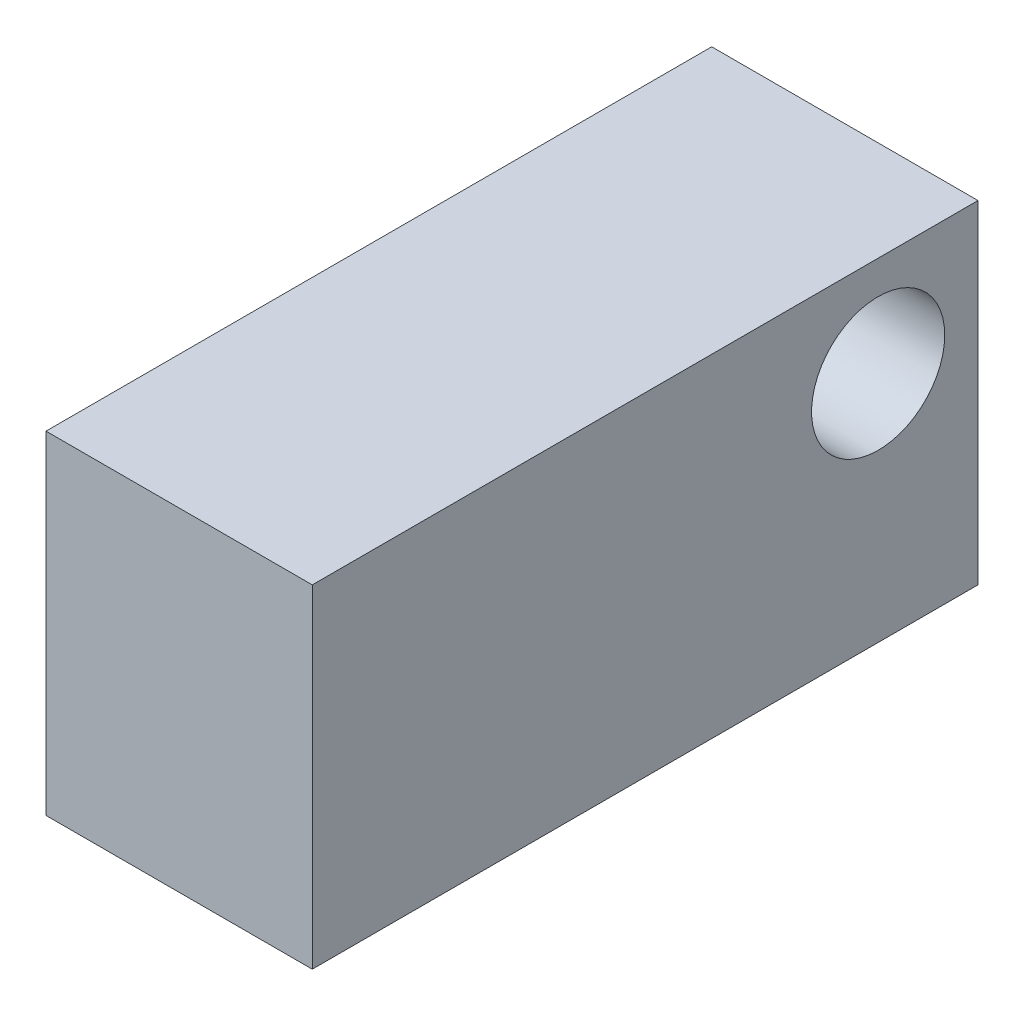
ISO-10303-21;
HEADER;
FILE_DESCRIPTION(('STEP AP214'),'2;1');
FILE_NAME('part.step','',(''),(''),'','','');
FILE_SCHEMA(('AUTOMOTIVE_DESIGN { 1 0 10303 214 1 1 1 1 }'));
ENDSEC;
DATA;
#1=APPLICATION_CONTEXT('core data for automotive mechanical design processes');
#2=APPLICATION_PROTOCOL_DEFINITION('international standard','automotive_design',2000,#1);
#3=PRODUCT_CONTEXT('',#1,'mechanical');
#4=PRODUCT('Part','Part','',(#3));
#5=PRODUCT_RELATED_PRODUCT_CATEGORY('part','',(#4));
#6=PRODUCT_DEFINITION_FORMATION('','',#4);
#7=PRODUCT_DEFINITION_CONTEXT('part definition',#1,'design');
#8=PRODUCT_DEFINITION('design','',#6,#7);
#9=PRODUCT_DEFINITION_SHAPE('','',#8);
#10=(LENGTH_UNIT() NAMED_UNIT(*) SI_UNIT(.MILLI.,.METRE.));
#11=(NAMED_UNIT(*) PLANE_ANGLE_UNIT() SI_UNIT($,.RADIAN.));
#12=(NAMED_UNIT(*) SI_UNIT($,.STERADIAN.) SOLID_ANGLE_UNIT());
#13=UNCERTAINTY_MEASURE_WITH_UNIT(LENGTH_MEASURE(1.E-05),#10,'distance_accuracy_value','');
#14=(GEOMETRIC_REPRESENTATION_CONTEXT(3) GLOBAL_UNCERTAINTY_ASSIGNED_CONTEXT((#13)) GLOBAL_UNIT_ASSIGNED_CONTEXT((#10,
#11,#12)) REPRESENTATION_CONTEXT('',''));
#15=CARTESIAN_POINT('',(0.,0.,0.));
#16=DIRECTION('',(0.,0.,1.));
#17=DIRECTION('',(1.,0.,0.));
#18=AXIS2_PLACEMENT_3D('',#15,#16,#17);
#19=CARTESIAN_POINT('',(-40.,-150.,120.));
#20=DIRECTION('',(0.,0.,1.));
#21=DIRECTION('',(0.,-1.,0.));
#22=AXIS2_PLACEMENT_3D('',#19,#20,#21);
#23=PLANE('',#22);
#24=DIRECTION('',(0.,-1.,0.));
#25=VECTOR('',#24,1.);
#26=CARTESIAN_POINT('',(0.,-150.,120.));
#27=LINE('',#26,#25);
#28=CARTESIAN_POINT('',(0.,-100.,120.));
#29=VERTEX_POINT('',#28);
#30=CARTESIAN_POINT('',(0.,-150.,120.));
#31=VERTEX_POINT('',#30);
#32=EDGE_CURVE('E100',#29,#31,#27,.T.);
#33=ORIENTED_EDGE('',*,*,#32,.F.);
#34=DIRECTION('',(1.,0.,0.));
#35=VECTOR('',#34,1.);
#36=CARTESIAN_POINT('',(-40.,-100.,120.));
#37=LINE('',#36,#35);
#38=CARTESIAN_POINT('',(-40.,-100.,120.));
#39=VERTEX_POINT('',#38);
#40=EDGE_CURVE('E11',#39,#29,#37,.T.);
#41=ORIENTED_EDGE('',*,*,#40,.F.);
#42=DIRECTION('',(0.,-1.,0.));
#43=VECTOR('',#42,1.);
#44=CARTESIAN_POINT('',(-40.,-150.,120.));
#45=LINE('',#44,#43);
#46=CARTESIAN_POINT('',(-40.,-150.,120.));
#47=VERTEX_POINT('',#46);
#48=EDGE_CURVE('E93',#39,#47,#45,.T.);
#49=ORIENTED_EDGE('',*,*,#48,.T.);
#50=DIRECTION('',(1.,0.,0.));
#51=VECTOR('',#50,1.);
#52=CARTESIAN_POINT('',(-40.,-150.,120.));
#53=LINE('',#52,#51);
#54=EDGE_CURVE('E38',#47,#31,#53,.T.);
#55=ORIENTED_EDGE('',*,*,#54,.T.);
#56=EDGE_LOOP('',(#33,#41,#49,#55));
#57=FACE_BOUND('',#56,.T.);
#58=ADVANCED_FACE('F35',(#57),#23,.T.);
#59=CARTESIAN_POINT('',(-40.,-100.,120.));
#60=DIRECTION('',(0.,1.,0.));
#61=DIRECTION('',(0.,0.,1.));
#62=AXIS2_PLACEMENT_3D('',#59,#60,#61);
#63=PLANE('',#62);
#64=DIRECTION('',(0.,0.,1.));
#65=VECTOR('',#64,1.);
#66=CARTESIAN_POINT('',(0.,-100.,120.));
#67=LINE('',#66,#65);
#68=CARTESIAN_POINT('',(0.,-100.,20.));
#69=VERTEX_POINT('',#68);
#70=EDGE_CURVE('E95',#69,#29,#67,.T.);
#71=ORIENTED_EDGE('',*,*,#70,.F.);
#72=DIRECTION('',(1.,0.,0.));
#73=VECTOR('',#72,1.);
#74=CARTESIAN_POINT('',(-40.,-100.,20.));
#75=LINE('',#74,#73);
#76=CARTESIAN_POINT('',(-40.,-100.,20.));
#77=VERTEX_POINT('',#76);
#78=EDGE_CURVE('E44',#77,#69,#75,.T.);
#79=ORIENTED_EDGE('',*,*,#78,.F.);
#80=DIRECTION('',(0.,0.,1.));
#81=VECTOR('',#80,1.);
#82=CARTESIAN_POINT('',(-40.,-100.,120.));
#83=LINE('',#82,#81);
#84=EDGE_CURVE('E90',#77,#39,#83,.T.);
#85=ORIENTED_EDGE('',*,*,#84,.T.);
#86=ORIENTED_EDGE('',*,*,#40,.T.);
#87=EDGE_LOOP('',(#71,#79,#85,#86));
#88=FACE_BOUND('',#87,.T.);
#89=ADVANCED_FACE('F111',(#88),#63,.T.);
#90=CARTESIAN_POINT('',(-40.,-150.,20.));
#91=DIRECTION('',(0.,0.,-1.));
#92=DIRECTION('',(0.,1.,0.));
#93=AXIS2_PLACEMENT_3D('',#90,#91,#92);
#94=PLANE('',#93);
#95=DIRECTION('',(0.,1.,0.));
#96=VECTOR('',#95,1.);
#97=CARTESIAN_POINT('',(0.,-150.,20.));
#98=LINE('',#97,#96);
#99=CARTESIAN_POINT('',(0.,-150.,20.));
#100=VERTEX_POINT('',#99);
#101=EDGE_CURVE('E85',#100,#69,#98,.T.);
#102=ORIENTED_EDGE('',*,*,#101,.F.);
#103=DIRECTION('',(1.,0.,0.));
#104=VECTOR('',#103,1.);
#105=CARTESIAN_POINT('',(-40.,-150.,20.));
#106=LINE('',#105,#104);
#107=CARTESIAN_POINT('',(-40.,-150.,20.));
#108=VERTEX_POINT('',#107);
#109=EDGE_CURVE('E80',#108,#100,#106,.T.);
#110=ORIENTED_EDGE('',*,*,#109,.F.);
#111=DIRECTION('',(0.,1.,0.));
#112=VECTOR('',#111,1.);
#113=CARTESIAN_POINT('',(-40.,-150.,20.));
#114=LINE('',#113,#112);
#115=EDGE_CURVE('E83',#108,#77,#114,.T.);
#116=ORIENTED_EDGE('',*,*,#115,.T.);
#117=ORIENTED_EDGE('',*,*,#78,.T.);
#118=EDGE_LOOP('',(#102,#110,#116,#117));
#119=FACE_BOUND('',#118,.T.);
#120=ADVANCED_FACE('F82',(#119),#94,.T.);
#121=CARTESIAN_POINT('',(-40.,-150.,120.));
#122=DIRECTION('',(0.,-1.,0.));
#123=DIRECTION('',(0.,0.,-1.));
#124=AXIS2_PLACEMENT_3D('',#121,#122,#123);
#125=PLANE('',#124);
#126=DIRECTION('',(0.,0.,-1.));
#127=VECTOR('',#126,1.);
#128=CARTESIAN_POINT('',(0.,-150.,120.));
#129=LINE('',#128,#127);
#130=EDGE_CURVE('E103',#31,#100,#129,.T.);
#131=ORIENTED_EDGE('',*,*,#130,.F.);
#132=ORIENTED_EDGE('',*,*,#54,.F.);
#133=DIRECTION('',(0.,0.,-1.));
#134=VECTOR('',#133,1.);
#135=CARTESIAN_POINT('',(-40.,-150.,120.));
#136=LINE('',#135,#134);
#137=EDGE_CURVE('E89',#47,#108,#136,.T.);
#138=ORIENTED_EDGE('',*,*,#137,.T.);
#139=ORIENTED_EDGE('',*,*,#109,.T.);
#140=EDGE_LOOP('',(#131,#132,#138,#139));
#141=FACE_BOUND('',#140,.T.);
#142=ADVANCED_FACE('F92',(#141),#125,.T.);
#143=CARTESIAN_POINT('',(-40.,-100.,120.));
#144=DIRECTION('',(-1.,0.,0.));
#145=DIRECTION('',(0.,0.,1.));
#146=AXIS2_PLACEMENT_3D('',#143,#144,#145);
#147=PLANE('',#146);
#148=CARTESIAN_POINT('',(-40.,-115.,35.));
#149=DIRECTION('',(1.,0.,0.));
#150=DIRECTION('',(0.,0.,-1.));
#151=AXIS2_PLACEMENT_3D('',#148,#149,#150);
#152=CIRCLE('',#151,10.);
#153=CARTESIAN_POINT('',(-40.,-115.,25.));
#154=VERTEX_POINT('',#153);
#155=EDGE_CURVE('E104',#154,#154,#152,.T.);
#156=ORIENTED_EDGE('',*,*,#155,.T.);
#157=EDGE_LOOP('',(#156));
#158=FACE_BOUND('',#157,.T.);
#159=ORIENTED_EDGE('',*,*,#48,.F.);
#160=ORIENTED_EDGE('',*,*,#84,.F.);
#161=ORIENTED_EDGE('',*,*,#115,.F.);
#162=ORIENTED_EDGE('',*,*,#137,.F.);
#163=EDGE_LOOP('',(#159,#160,#161,#162));
#164=FACE_BOUND('',#163,.T.);
#165=ADVANCED_FACE('F88',(#158,#164),#147,.T.);
#166=CARTESIAN_POINT('',(0.,-100.,120.));
#167=DIRECTION('',(-1.,0.,0.));
#168=DIRECTION('',(0.,0.,1.));
#169=AXIS2_PLACEMENT_3D('',#166,#167,#168);
#170=PLANE('',#169);
#171=CARTESIAN_POINT('',(0.,-115.,35.));
#172=DIRECTION('',(1.,0.,0.));
#173=DIRECTION('',(0.,0.,-1.));
#174=AXIS2_PLACEMENT_3D('',#171,#172,#173);
#175=CIRCLE('',#174,10.);
#176=CARTESIAN_POINT('',(0.,-115.,25.));
#177=VERTEX_POINT('',#176);
#178=EDGE_CURVE('E141',#177,#177,#175,.T.);
#179=ORIENTED_EDGE('',*,*,#178,.F.);
#180=EDGE_LOOP('',(#179));
#181=FACE_BOUND('',#180,.T.);
#182=ORIENTED_EDGE('',*,*,#32,.T.);
#183=ORIENTED_EDGE('',*,*,#130,.T.);
#184=ORIENTED_EDGE('',*,*,#101,.T.);
#185=ORIENTED_EDGE('',*,*,#70,.T.);
#186=EDGE_LOOP('',(#182,#183,#184,#185));
#187=FACE_BOUND('',#186,.T.);
#188=ADVANCED_FACE('F110',(#181,#187),#170,.F.);
#189=CARTESIAN_POINT('',(-40.,-115.,35.));
#190=DIRECTION('',(1.,0.,0.));
#191=DIRECTION('',(0.,0.,-1.));
#192=AXIS2_PLACEMENT_3D('',#189,#190,#191);
#193=CYLINDRICAL_SURFACE('',#192,10.);
#194=ORIENTED_EDGE('',*,*,#155,.F.);
#195=EDGE_LOOP('',(#194));
#196=FACE_BOUND('',#195,.T.);
#197=ORIENTED_EDGE('',*,*,#178,.T.);
#198=EDGE_LOOP('',(#197));
#199=FACE_BOUND('',#198,.T.);
#200=ADVANCED_FACE('F129',(#196,#199),#193,.F.);
#201=CLOSED_SHELL('',(#58,#89,#120,#142,#165,#188,#200));
#202=MANIFOLD_SOLID_BREP('B2',#201);
#203=ADVANCED_BREP_SHAPE_REPRESENTATION('',(#18,#202),#14);
#204=SHAPE_DEFINITION_REPRESENTATION(#9,#203);
ENDSEC;
END-ISO-10303-21;
